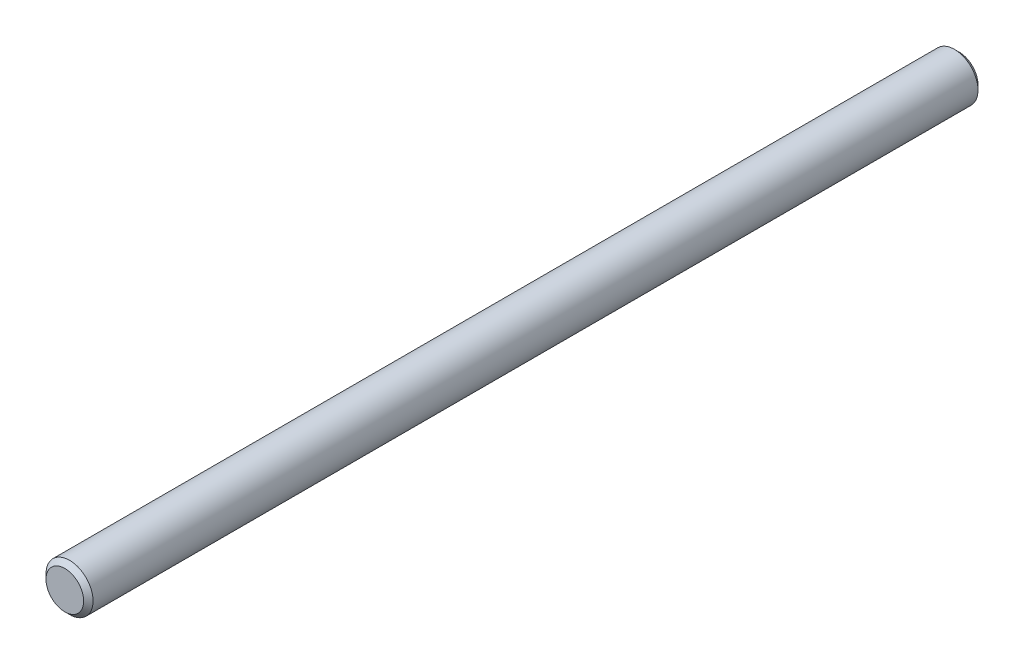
from build123d import *

# Parameters (mm, degrees)
ESQUISSE1_R      = 1
EXTRUSION1_DEPTH = 38
CHANFREIN1_SIZE  = 0.2


with BuildPart() as part:
    # Esquisse1 → Extrusion1 (new body)
    with BuildSketch(Plane.XY):
        Circle(ESQUISSE1_R)
    extrude(amount=-EXTRUSION1_DEPTH)

    # Chanfrein1
    chanfrein1_edges = [part.edges().sort_by_distance(p)[0] for p in [
        (-1, 0, 0),
        (-1, 0, -38),
    ]]
    chamfer(chanfrein1_edges, length=CHANFREIN1_SIZE)


solid = part.part
